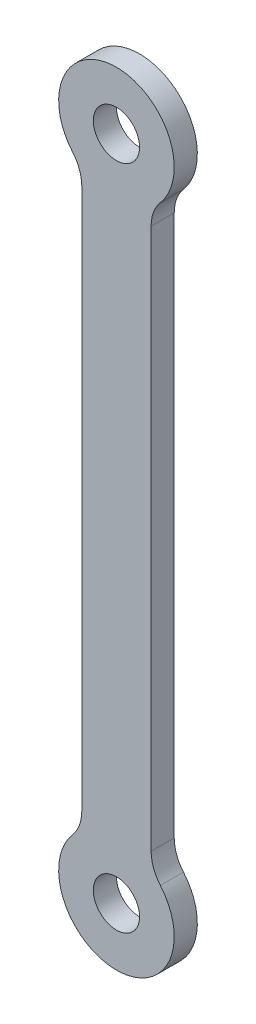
from build123d import *

# Parameters (mm, degrees)
ESQUISSE1_R      = 6
EXTRUSION1_DEPTH = 6
CONG_1_R         = 10


with BuildPart() as part:
    # Esquisse1 → Extrusion1 (new body)
    with BuildSketch(Plane.XY):
        with BuildLine():
            Line((-9, 12), (-9, 161))
            ThreePointArc((-9, 161), (0, 188), (9, 161))
            Line((9, 161), (9, 12))
            ThreePointArc((9, 12), (0, -15), (-9, 12))
        make_face()
        with Locations((0, 173)):
            Circle(ESQUISSE1_R, mode=Mode.SUBTRACT)
        Circle(ESQUISSE1_R, mode=Mode.SUBTRACT)
    extrude(amount=EXTRUSION1_DEPTH)

    # Cong_1
    cong_1_edges = [part.edges().sort_by_distance(p)[0] for p in [
        (-9, 12, 3),
        (-9, 161, 3),
        (9, 161, 3),
        (9, 12, 3),
    ]]
    fillet(cong_1_edges, radius=CONG_1_R)


solid = part.part
